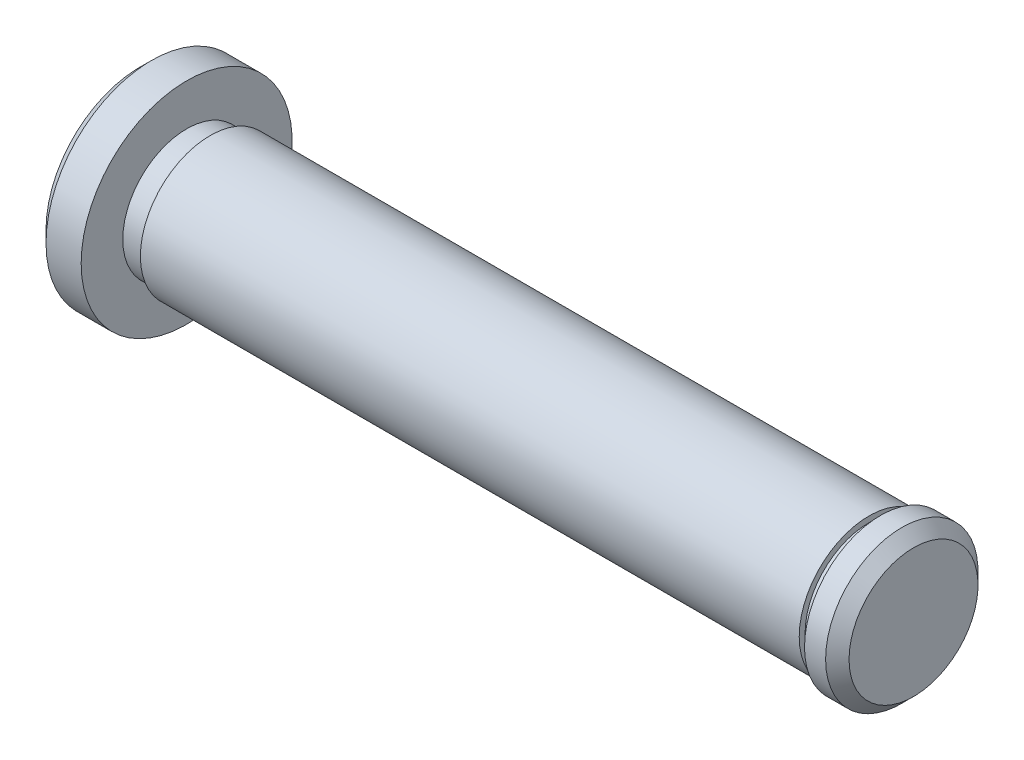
ISO-10303-21;
HEADER;
FILE_DESCRIPTION(('STEP AP214'),'2;1');
FILE_NAME('part.step','',(''),(''),'','','');
FILE_SCHEMA(('AUTOMOTIVE_DESIGN { 1 0 10303 214 1 1 1 1 }'));
ENDSEC;
DATA;
#1=APPLICATION_CONTEXT('core data for automotive mechanical design processes');
#2=APPLICATION_PROTOCOL_DEFINITION('international standard','automotive_design',2000,#1);
#3=PRODUCT_CONTEXT('',#1,'mechanical');
#4=PRODUCT('Part','Part','',(#3));
#5=PRODUCT_RELATED_PRODUCT_CATEGORY('part','',(#4));
#6=PRODUCT_DEFINITION_FORMATION('','',#4);
#7=PRODUCT_DEFINITION_CONTEXT('part definition',#1,'design');
#8=PRODUCT_DEFINITION('design','',#6,#7);
#9=PRODUCT_DEFINITION_SHAPE('','',#8);
#10=(LENGTH_UNIT() NAMED_UNIT(*) SI_UNIT(.MILLI.,.METRE.));
#11=(NAMED_UNIT(*) PLANE_ANGLE_UNIT() SI_UNIT($,.RADIAN.));
#12=(NAMED_UNIT(*) SI_UNIT($,.STERADIAN.) SOLID_ANGLE_UNIT());
#13=UNCERTAINTY_MEASURE_WITH_UNIT(LENGTH_MEASURE(1.E-05),#10,'distance_accuracy_value','');
#14=(GEOMETRIC_REPRESENTATION_CONTEXT(3) GLOBAL_UNCERTAINTY_ASSIGNED_CONTEXT((#13)) GLOBAL_UNIT_ASSIGNED_CONTEXT((#10,
#11,#12)) REPRESENTATION_CONTEXT('',''));
#15=CARTESIAN_POINT('',(0.,0.,0.));
#16=DIRECTION('',(0.,0.,1.));
#17=DIRECTION('',(1.,0.,0.));
#18=AXIS2_PLACEMENT_3D('',#15,#16,#17);
#19=CARTESIAN_POINT('',(0.,0.,0.));
#20=DIRECTION('',(-1.,0.,0.));
#21=DIRECTION('',(0.,0.,1.));
#22=AXIS2_PLACEMENT_3D('',#19,#20,#21);
#23=PLANE('',#22);
#24=CARTESIAN_POINT('',(0.,0.,0.));
#25=DIRECTION('',(-1.,0.,0.));
#26=DIRECTION('',(0.,0.,1.));
#27=AXIS2_PLACEMENT_3D('',#24,#25,#26);
#28=CIRCLE('',#27,8.);
#29=CARTESIAN_POINT('',(0.,0.,8.));
#30=VERTEX_POINT('',#29);
#31=EDGE_CURVE('E51',#30,#30,#28,.T.);
#32=ORIENTED_EDGE('',*,*,#31,.T.);
#33=EDGE_LOOP('',(#32));
#34=FACE_BOUND('',#33,.T.);
#35=ADVANCED_FACE('F43',(#34),#23,.T.);
#36=CARTESIAN_POINT('',(6.,0.,0.));
#37=DIRECTION('',(-1.,0.,0.));
#38=DIRECTION('',(0.,0.,1.));
#39=AXIS2_PLACEMENT_3D('',#36,#37,#38);
#40=CYLINDRICAL_SURFACE('',#39,9.);
#41=CARTESIAN_POINT('',(0.999999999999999,0.,0.));
#42=DIRECTION('',(-1.,0.,0.));
#43=DIRECTION('',(0.,0.,1.));
#44=AXIS2_PLACEMENT_3D('',#41,#42,#43);
#45=CIRCLE('',#44,9.);
#46=CARTESIAN_POINT('',(0.999999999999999,0.,9.));
#47=VERTEX_POINT('',#46);
#48=EDGE_CURVE('E10',#47,#47,#45,.F.);
#49=ORIENTED_EDGE('',*,*,#48,.T.);
#50=EDGE_LOOP('',(#49));
#51=FACE_BOUND('',#50,.T.);
#52=CARTESIAN_POINT('',(4.,0.,0.));
#53=DIRECTION('',(-1.,0.,0.));
#54=DIRECTION('',(0.,0.,1.));
#55=AXIS2_PLACEMENT_3D('',#52,#53,#54);
#56=CIRCLE('',#55,9.);
#57=CARTESIAN_POINT('',(4.,0.,9.));
#58=VERTEX_POINT('',#57);
#59=EDGE_CURVE('E68',#58,#58,#56,.T.);
#60=ORIENTED_EDGE('',*,*,#59,.T.);
#61=EDGE_LOOP('',(#60));
#62=FACE_BOUND('',#61,.T.);
#63=ADVANCED_FACE('F90',(#51,#62),#40,.T.);
#64=CARTESIAN_POINT('',(4.,0.,0.));
#65=DIRECTION('',(-1.,0.,0.));
#66=DIRECTION('',(0.,0.,1.));
#67=AXIS2_PLACEMENT_3D('',#64,#65,#66);
#68=PLANE('',#67);
#69=ORIENTED_EDGE('',*,*,#59,.F.);
#70=EDGE_LOOP('',(#69));
#71=FACE_BOUND('',#70,.T.);
#72=CARTESIAN_POINT('',(4.,0.,0.));
#73=DIRECTION('',(-1.,0.,0.));
#74=DIRECTION('',(0.,0.,1.));
#75=AXIS2_PLACEMENT_3D('',#72,#73,#74);
#76=CIRCLE('',#75,5.45);
#77=CARTESIAN_POINT('',(4.,0.,5.45));
#78=VERTEX_POINT('',#77);
#79=EDGE_CURVE('E83',#78,#78,#76,.T.);
#80=ORIENTED_EDGE('',*,*,#79,.T.);
#81=EDGE_LOOP('',(#80));
#82=FACE_BOUND('',#81,.T.);
#83=ADVANCED_FACE('F93',(#71,#82),#68,.F.);
#84=CARTESIAN_POINT('',(6.,0.,0.));
#85=DIRECTION('',(-1.,0.,0.));
#86=DIRECTION('',(0.,0.,1.));
#87=AXIS2_PLACEMENT_3D('',#84,#85,#86);
#88=CYLINDRICAL_SURFACE('',#87,5.45);
#89=CARTESIAN_POINT('',(6.,0.,0.));
#90=DIRECTION('',(-1.,0.,0.));
#91=DIRECTION('',(0.,0.,1.));
#92=AXIS2_PLACEMENT_3D('',#89,#90,#91);
#93=CIRCLE('',#92,5.45);
#94=CARTESIAN_POINT('',(6.,0.,5.45));
#95=VERTEX_POINT('',#94);
#96=EDGE_CURVE('E76',#95,#95,#93,.T.);
#97=ORIENTED_EDGE('',*,*,#96,.T.);
#98=EDGE_LOOP('',(#97));
#99=FACE_BOUND('',#98,.T.);
#100=ORIENTED_EDGE('',*,*,#79,.F.);
#101=EDGE_LOOP('',(#100));
#102=FACE_BOUND('',#101,.T.);
#103=ADVANCED_FACE('F94',(#99,#102),#88,.T.);
#104=CARTESIAN_POINT('',(6.,0.,0.));
#105=DIRECTION('',(-1.,0.,0.));
#106=DIRECTION('',(0.,0.,1.));
#107=AXIS2_PLACEMENT_3D('',#104,#105,#106);
#108=PLANE('',#107);
#109=CARTESIAN_POINT('',(6.,0.,0.));
#110=DIRECTION('',(-1.,0.,0.));
#111=DIRECTION('',(0.,0.,1.));
#112=AXIS2_PLACEMENT_3D('',#109,#110,#111);
#113=CIRCLE('',#112,5.95);
#114=CARTESIAN_POINT('',(6.,0.,5.95));
#115=VERTEX_POINT('',#114);
#116=EDGE_CURVE('E79',#115,#115,#113,.T.);
#117=ORIENTED_EDGE('',*,*,#116,.T.);
#118=EDGE_LOOP('',(#117));
#119=FACE_BOUND('',#118,.T.);
#120=ORIENTED_EDGE('',*,*,#96,.F.);
#121=EDGE_LOOP('',(#120));
#122=FACE_BOUND('',#121,.T.);
#123=ADVANCED_FACE('F97',(#119,#122),#108,.T.);
#124=CARTESIAN_POINT('',(6.,0.,0.));
#125=DIRECTION('',(-1.,0.,0.));
#126=DIRECTION('',(0.,0.,1.));
#127=AXIS2_PLACEMENT_3D('',#124,#125,#126);
#128=CYLINDRICAL_SURFACE('',#127,5.95);
#129=CARTESIAN_POINT('',(62.2,0.,0.));
#130=DIRECTION('',(-1.,0.,0.));
#131=DIRECTION('',(0.,0.,1.));
#132=AXIS2_PLACEMENT_3D('',#129,#130,#131);
#133=CIRCLE('',#132,5.95);
#134=CARTESIAN_POINT('',(62.2,0.,5.95));
#135=VERTEX_POINT('',#134);
#136=EDGE_CURVE('E74',#135,#135,#133,.T.);
#137=ORIENTED_EDGE('',*,*,#136,.T.);
#138=EDGE_LOOP('',(#137));
#139=FACE_BOUND('',#138,.T.);
#140=ORIENTED_EDGE('',*,*,#116,.F.);
#141=EDGE_LOOP('',(#140));
#142=FACE_BOUND('',#141,.T.);
#143=ADVANCED_FACE('F104',(#139,#142),#128,.T.);
#144=CARTESIAN_POINT('',(62.2,0.,0.));
#145=DIRECTION('',(-1.,0.,0.));
#146=DIRECTION('',(0.,0.,1.));
#147=AXIS2_PLACEMENT_3D('',#144,#145,#146);
#148=PLANE('',#147);
#149=ORIENTED_EDGE('',*,*,#136,.F.);
#150=EDGE_LOOP('',(#149));
#151=FACE_BOUND('',#150,.T.);
#152=CARTESIAN_POINT('',(62.2,0.,0.));
#153=DIRECTION('',(-1.,0.,0.));
#154=DIRECTION('',(0.,0.,1.));
#155=AXIS2_PLACEMENT_3D('',#152,#153,#154);
#156=CIRCLE('',#155,5.45);
#157=CARTESIAN_POINT('',(62.2,0.,5.45));
#158=VERTEX_POINT('',#157);
#159=EDGE_CURVE('E72',#158,#158,#156,.T.);
#160=ORIENTED_EDGE('',*,*,#159,.T.);
#161=EDGE_LOOP('',(#160));
#162=FACE_BOUND('',#161,.T.);
#163=ADVANCED_FACE('F174',(#151,#162),#148,.F.);
#164=CARTESIAN_POINT('',(6.,0.,0.));
#165=DIRECTION('',(-1.,0.,0.));
#166=DIRECTION('',(0.,0.,1.));
#167=AXIS2_PLACEMENT_3D('',#164,#165,#166);
#168=CYLINDRICAL_SURFACE('',#167,5.45);
#169=CARTESIAN_POINT('',(63.2,0.,0.));
#170=DIRECTION('',(-1.,0.,0.));
#171=DIRECTION('',(0.,0.,1.));
#172=AXIS2_PLACEMENT_3D('',#169,#170,#171);
#173=CIRCLE('',#172,5.45);
#174=CARTESIAN_POINT('',(63.2,0.,5.45));
#175=VERTEX_POINT('',#174);
#176=EDGE_CURVE('E65',#175,#175,#173,.T.);
#177=ORIENTED_EDGE('',*,*,#176,.T.);
#178=EDGE_LOOP('',(#177));
#179=FACE_BOUND('',#178,.T.);
#180=ORIENTED_EDGE('',*,*,#159,.F.);
#181=EDGE_LOOP('',(#180));
#182=FACE_BOUND('',#181,.T.);
#183=ADVANCED_FACE('F130',(#179,#182),#168,.T.);
#184=CARTESIAN_POINT('',(66.,0.,0.));
#185=DIRECTION('',(-1.,0.,0.));
#186=DIRECTION('',(0.,0.,1.));
#187=AXIS2_PLACEMENT_3D('',#184,#185,#186);
#188=PLANE('',#187);
#189=CARTESIAN_POINT('',(66.,0.,0.));
#190=DIRECTION('',(-1.,0.,0.));
#191=DIRECTION('',(0.,0.,1.));
#192=AXIS2_PLACEMENT_3D('',#189,#190,#191);
#193=CIRCLE('',#192,5.50000000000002);
#194=CARTESIAN_POINT('',(66.,0.,5.50000000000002));
#195=VERTEX_POINT('',#194);
#196=EDGE_CURVE('E54',#195,#195,#193,.F.);
#197=ORIENTED_EDGE('',*,*,#196,.T.);
#198=EDGE_LOOP('',(#197));
#199=FACE_BOUND('',#198,.T.);
#200=ADVANCED_FACE('F125',(#199),#188,.F.);
#201=CARTESIAN_POINT('',(6.,0.,0.));
#202=DIRECTION('',(-1.,0.,0.));
#203=DIRECTION('',(0.,0.,1.));
#204=AXIS2_PLACEMENT_3D('',#201,#202,#203);
#205=CYLINDRICAL_SURFACE('',#204,6.5);
#206=CARTESIAN_POINT('',(65.,0.,0.));
#207=DIRECTION('',(-1.,0.,0.));
#208=DIRECTION('',(0.,0.,1.));
#209=AXIS2_PLACEMENT_3D('',#206,#207,#208);
#210=CIRCLE('',#209,6.5);
#211=CARTESIAN_POINT('',(65.,0.,6.5));
#212=VERTEX_POINT('',#211);
#213=EDGE_CURVE('E56',#212,#212,#210,.T.);
#214=ORIENTED_EDGE('',*,*,#213,.T.);
#215=EDGE_LOOP('',(#214));
#216=FACE_BOUND('',#215,.T.);
#217=CARTESIAN_POINT('',(63.2,0.,0.));
#218=DIRECTION('',(-1.,0.,0.));
#219=DIRECTION('',(0.,0.,1.));
#220=AXIS2_PLACEMENT_3D('',#217,#218,#219);
#221=CIRCLE('',#220,6.5);
#222=CARTESIAN_POINT('',(63.2,0.,6.5));
#223=VERTEX_POINT('',#222);
#224=EDGE_CURVE('E61',#223,#223,#221,.T.);
#225=ORIENTED_EDGE('',*,*,#224,.F.);
#226=EDGE_LOOP('',(#225));
#227=FACE_BOUND('',#226,.T.);
#228=ADVANCED_FACE('F127',(#216,#227),#205,.T.);
#229=CARTESIAN_POINT('',(63.2,0.,0.));
#230=DIRECTION('',(-1.,0.,0.));
#231=DIRECTION('',(0.,0.,1.));
#232=AXIS2_PLACEMENT_3D('',#229,#230,#231);
#233=PLANE('',#232);
#234=ORIENTED_EDGE('',*,*,#176,.F.);
#235=EDGE_LOOP('',(#234));
#236=FACE_BOUND('',#235,.T.);
#237=ORIENTED_EDGE('',*,*,#224,.T.);
#238=EDGE_LOOP('',(#237));
#239=FACE_BOUND('',#238,.T.);
#240=ADVANCED_FACE('F133',(#236,#239),#233,.T.);
#241=CARTESIAN_POINT('',(65.,0.,0.));
#242=DIRECTION('',(-1.,0.,0.));
#243=DIRECTION('',(0.,0.,1.));
#244=AXIS2_PLACEMENT_3D('',#241,#242,#243);
#245=CONICAL_SURFACE('',#244,6.5,0.785398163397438);
#246=ORIENTED_EDGE('',*,*,#196,.F.);
#247=EDGE_LOOP('',(#246));
#248=FACE_BOUND('',#247,.T.);
#249=ORIENTED_EDGE('',*,*,#213,.F.);
#250=EDGE_LOOP('',(#249));
#251=FACE_BOUND('',#250,.T.);
#252=ADVANCED_FACE('F128',(#248,#251),#245,.T.);
#253=CARTESIAN_POINT('',(0.,0.,0.));
#254=DIRECTION('',(1.,0.,0.));
#255=DIRECTION('',(0.,0.,-1.));
#256=AXIS2_PLACEMENT_3D('',#253,#254,#255);
#257=CONICAL_SURFACE('',#256,8.,0.785398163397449);
#258=ORIENTED_EDGE('',*,*,#48,.F.);
#259=EDGE_LOOP('',(#258));
#260=FACE_BOUND('',#259,.T.);
#261=ORIENTED_EDGE('',*,*,#31,.F.);
#262=EDGE_LOOP('',(#261));
#263=FACE_BOUND('',#262,.T.);
#264=ADVANCED_FACE('F46',(#260,#263),#257,.T.);
#265=CLOSED_SHELL('',(#35,#63,#83,#103,#123,#143,#163,#183,#200,#228,#240,#252,#264));
#266=MANIFOLD_SOLID_BREP('B2',#265);
#267=ADVANCED_BREP_SHAPE_REPRESENTATION('',(#18,#266),#14);
#268=SHAPE_DEFINITION_REPRESENTATION(#9,#267);
ENDSEC;
END-ISO-10303-21;
